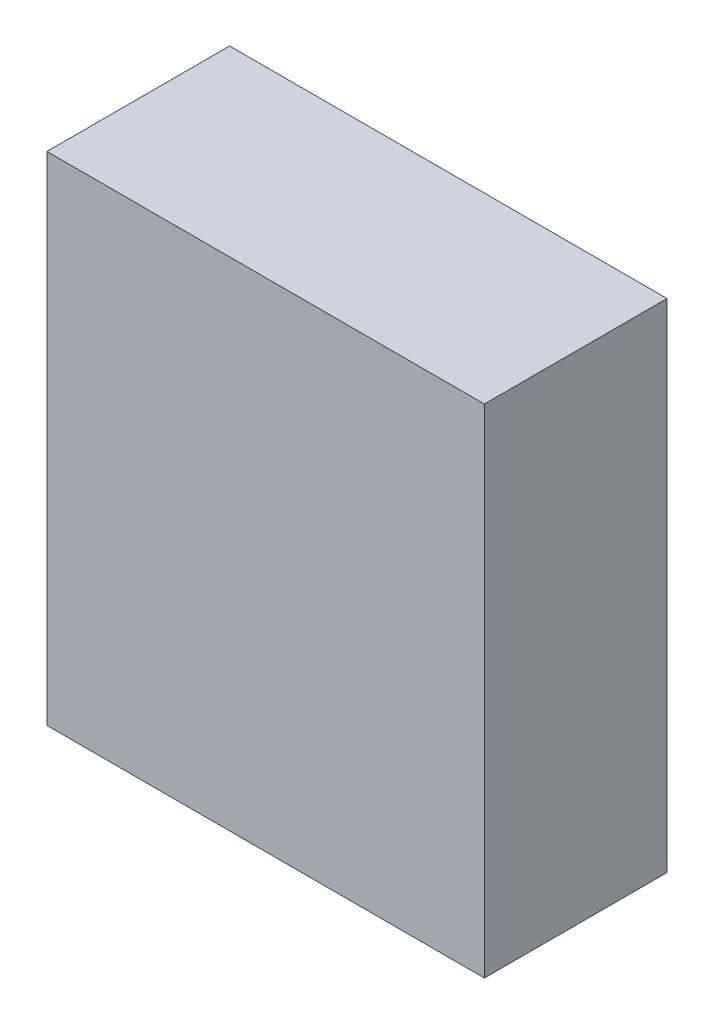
ISO-10303-21;
HEADER;
FILE_DESCRIPTION(('STEP AP214'),'2;1');
FILE_NAME('part.step','',(''),(''),'','','');
FILE_SCHEMA(('AUTOMOTIVE_DESIGN { 1 0 10303 214 1 1 1 1 }'));
ENDSEC;
DATA;
#1=APPLICATION_CONTEXT('core data for automotive mechanical design processes');
#2=APPLICATION_PROTOCOL_DEFINITION('international standard','automotive_design',2000,#1);
#3=PRODUCT_CONTEXT('',#1,'mechanical');
#4=PRODUCT('Part','Part','',(#3));
#5=PRODUCT_RELATED_PRODUCT_CATEGORY('part','',(#4));
#6=PRODUCT_DEFINITION_FORMATION('','',#4);
#7=PRODUCT_DEFINITION_CONTEXT('part definition',#1,'design');
#8=PRODUCT_DEFINITION('design','',#6,#7);
#9=PRODUCT_DEFINITION_SHAPE('','',#8);
#10=(LENGTH_UNIT() NAMED_UNIT(*) SI_UNIT(.MILLI.,.METRE.));
#11=(NAMED_UNIT(*) PLANE_ANGLE_UNIT() SI_UNIT($,.RADIAN.));
#12=(NAMED_UNIT(*) SI_UNIT($,.STERADIAN.) SOLID_ANGLE_UNIT());
#13=UNCERTAINTY_MEASURE_WITH_UNIT(LENGTH_MEASURE(1.E-05),#10,'distance_accuracy_value','');
#14=(GEOMETRIC_REPRESENTATION_CONTEXT(3) GLOBAL_UNCERTAINTY_ASSIGNED_CONTEXT((#13)) GLOBAL_UNIT_ASSIGNED_CONTEXT((#10,
#11,#12)) REPRESENTATION_CONTEXT('',''));
#15=CARTESIAN_POINT('',(0.,0.,0.));
#16=DIRECTION('',(0.,0.,1.));
#17=DIRECTION('',(1.,0.,0.));
#18=AXIS2_PLACEMENT_3D('',#15,#16,#17);
#19=CARTESIAN_POINT('',(0.,0.,0.70000114));
#20=DIRECTION('',(0.,0.,-1.));
#21=DIRECTION('',(0.,-1.,0.));
#22=AXIS2_PLACEMENT_3D('',#19,#20,#21);
#23=PLANE('',#22);
#24=DIRECTION('',(1.,0.,0.));
#25=VECTOR('',#24,1.);
#26=CARTESIAN_POINT('',(-0.8382,0.9525,0.70000114));
#27=LINE('',#26,#25);
#28=CARTESIAN_POINT('',(-0.8382,0.9525,0.70000114));
#29=VERTEX_POINT('',#28);
#30=CARTESIAN_POINT('',(0.8382,0.9525,0.70000114));
#31=VERTEX_POINT('',#30);
#32=EDGE_CURVE('E20',#29,#31,#27,.T.);
#33=ORIENTED_EDGE('',*,*,#32,.F.);
#34=DIRECTION('',(0.,1.,0.));
#35=VECTOR('',#34,1.);
#36=CARTESIAN_POINT('',(-0.8382,-0.9525,0.70000114));
#37=LINE('',#36,#35);
#38=CARTESIAN_POINT('',(-0.8382,-0.9525,0.70000114));
#39=VERTEX_POINT('',#38);
#40=EDGE_CURVE('E96',#39,#29,#37,.T.);
#41=ORIENTED_EDGE('',*,*,#40,.F.);
#42=DIRECTION('',(-1.,0.,0.));
#43=VECTOR('',#42,1.);
#44=CARTESIAN_POINT('',(0.8382,-0.9525,0.70000114));
#45=LINE('',#44,#43);
#46=CARTESIAN_POINT('',(0.8382,-0.9525,0.70000114));
#47=VERTEX_POINT('',#46);
#48=EDGE_CURVE('E84',#47,#39,#45,.T.);
#49=ORIENTED_EDGE('',*,*,#48,.F.);
#50=DIRECTION('',(0.,-1.,0.));
#51=VECTOR('',#50,1.);
#52=CARTESIAN_POINT('',(0.8382,0.9525,0.70000114));
#53=LINE('',#52,#51);
#54=EDGE_CURVE('E88',#31,#47,#53,.T.);
#55=ORIENTED_EDGE('',*,*,#54,.F.);
#56=EDGE_LOOP('',(#33,#41,#49,#55));
#57=FACE_BOUND('',#56,.T.);
#58=ADVANCED_FACE('F17',(#57),#23,.F.);
#59=CARTESIAN_POINT('',(0.,0.,0.));
#60=DIRECTION('',(0.,0.,-1.));
#61=DIRECTION('',(0.,-1.,0.));
#62=AXIS2_PLACEMENT_3D('',#59,#60,#61);
#63=PLANE('',#62);
#64=DIRECTION('',(0.,-1.,0.));
#65=VECTOR('',#64,1.);
#66=CARTESIAN_POINT('',(0.8382,0.9525,0.));
#67=LINE('',#66,#65);
#68=CARTESIAN_POINT('',(0.8382,0.9525,0.));
#69=VERTEX_POINT('',#68);
#70=CARTESIAN_POINT('',(0.8382,-0.9525,0.));
#71=VERTEX_POINT('',#70);
#72=EDGE_CURVE('E72',#69,#71,#67,.T.);
#73=ORIENTED_EDGE('',*,*,#72,.T.);
#74=DIRECTION('',(-1.,0.,0.));
#75=VECTOR('',#74,1.);
#76=CARTESIAN_POINT('',(0.8382,-0.9525,0.));
#77=LINE('',#76,#75);
#78=CARTESIAN_POINT('',(-0.8382,-0.9525,0.));
#79=VERTEX_POINT('',#78);
#80=EDGE_CURVE('E100',#71,#79,#77,.T.);
#81=ORIENTED_EDGE('',*,*,#80,.T.);
#82=DIRECTION('',(0.,1.,0.));
#83=VECTOR('',#82,1.);
#84=CARTESIAN_POINT('',(-0.8382,-0.9525,0.));
#85=LINE('',#84,#83);
#86=CARTESIAN_POINT('',(-0.8382,0.9525,0.));
#87=VERTEX_POINT('',#86);
#88=EDGE_CURVE('E74',#79,#87,#85,.T.);
#89=ORIENTED_EDGE('',*,*,#88,.T.);
#90=DIRECTION('',(1.,0.,0.));
#91=VECTOR('',#90,1.);
#92=CARTESIAN_POINT('',(-0.8382,0.9525,0.));
#93=LINE('',#92,#91);
#94=EDGE_CURVE('E11',#87,#69,#93,.T.);
#95=ORIENTED_EDGE('',*,*,#94,.T.);
#96=EDGE_LOOP('',(#73,#81,#89,#95));
#97=FACE_BOUND('',#96,.T.);
#98=ADVANCED_FACE('F70',(#97),#63,.T.);
#99=CARTESIAN_POINT('',(-0.8382,0.9525,0.));
#100=DIRECTION('',(0.,1.,0.));
#101=DIRECTION('',(1.,0.,0.));
#102=AXIS2_PLACEMENT_3D('',#99,#100,#101);
#103=PLANE('',#102);
#104=DIRECTION('',(0.,0.,1.));
#105=VECTOR('',#104,1.);
#106=CARTESIAN_POINT('',(-0.8382,0.9525,0.));
#107=LINE('',#106,#105);
#108=EDGE_CURVE('E99',#87,#29,#107,.T.);
#109=ORIENTED_EDGE('',*,*,#108,.T.);
#110=ORIENTED_EDGE('',*,*,#32,.T.);
#111=DIRECTION('',(0.,0.,1.));
#112=VECTOR('',#111,1.);
#113=CARTESIAN_POINT('',(0.8382,0.9525,0.));
#114=LINE('',#113,#112);
#115=EDGE_CURVE('E80',#69,#31,#114,.T.);
#116=ORIENTED_EDGE('',*,*,#115,.F.);
#117=ORIENTED_EDGE('',*,*,#94,.F.);
#118=EDGE_LOOP('',(#109,#110,#116,#117));
#119=FACE_BOUND('',#118,.T.);
#120=ADVANCED_FACE('F86',(#119),#103,.T.);
#121=CARTESIAN_POINT('',(-0.8382,-0.9525,0.));
#122=DIRECTION('',(-1.,0.,0.));
#123=DIRECTION('',(0.,0.,1.));
#124=AXIS2_PLACEMENT_3D('',#121,#122,#123);
#125=PLANE('',#124);
#126=DIRECTION('',(0.,0.,1.));
#127=VECTOR('',#126,1.);
#128=CARTESIAN_POINT('',(-0.8382,-0.9525,0.));
#129=LINE('',#128,#127);
#130=EDGE_CURVE('E102',#79,#39,#129,.T.);
#131=ORIENTED_EDGE('',*,*,#130,.T.);
#132=ORIENTED_EDGE('',*,*,#40,.T.);
#133=ORIENTED_EDGE('',*,*,#108,.F.);
#134=ORIENTED_EDGE('',*,*,#88,.F.);
#135=EDGE_LOOP('',(#131,#132,#133,#134));
#136=FACE_BOUND('',#135,.T.);
#137=ADVANCED_FACE('F118',(#136),#125,.T.);
#138=CARTESIAN_POINT('',(0.8382,-0.9525,0.));
#139=DIRECTION('',(0.,-1.,0.));
#140=DIRECTION('',(0.,0.,-1.));
#141=AXIS2_PLACEMENT_3D('',#138,#139,#140);
#142=PLANE('',#141);
#143=DIRECTION('',(0.,0.,1.));
#144=VECTOR('',#143,1.);
#145=CARTESIAN_POINT('',(0.8382,-0.9525,0.));
#146=LINE('',#145,#144);
#147=EDGE_CURVE('E82',#71,#47,#146,.T.);
#148=ORIENTED_EDGE('',*,*,#147,.T.);
#149=ORIENTED_EDGE('',*,*,#48,.T.);
#150=ORIENTED_EDGE('',*,*,#130,.F.);
#151=ORIENTED_EDGE('',*,*,#80,.F.);
#152=EDGE_LOOP('',(#148,#149,#150,#151));
#153=FACE_BOUND('',#152,.T.);
#154=ADVANCED_FACE('F121',(#153),#142,.T.);
#155=CARTESIAN_POINT('',(0.8382,0.9525,0.));
#156=DIRECTION('',(1.,0.,0.));
#157=DIRECTION('',(0.,1.,0.));
#158=AXIS2_PLACEMENT_3D('',#155,#156,#157);
#159=PLANE('',#158);
#160=ORIENTED_EDGE('',*,*,#115,.T.);
#161=ORIENTED_EDGE('',*,*,#54,.T.);
#162=ORIENTED_EDGE('',*,*,#147,.F.);
#163=ORIENTED_EDGE('',*,*,#72,.F.);
#164=EDGE_LOOP('',(#160,#161,#162,#163));
#165=FACE_BOUND('',#164,.T.);
#166=ADVANCED_FACE('F78',(#165),#159,.T.);
#167=CLOSED_SHELL('',(#58,#98,#120,#137,#154,#166));
#168=MANIFOLD_SOLID_BREP('B1',#167);
#169=ADVANCED_BREP_SHAPE_REPRESENTATION('',(#18,#168),#14);
#170=SHAPE_DEFINITION_REPRESENTATION(#9,#169);
ENDSEC;
END-ISO-10303-21;
